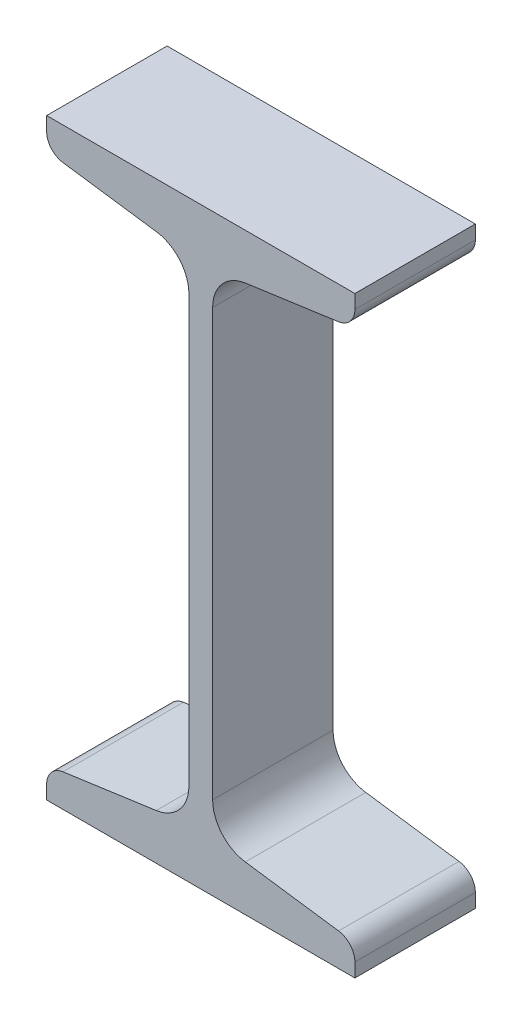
from build123d import *

# Parameters (mm, degrees)
BASESECTION_DEPTH = 12.7


with BuildPart() as part:
    # Sketch1 → BaseSection (new, symmetric)
    with BuildSketch(Plane.XY):
        with BuildLine():
            Line((-32.5, 62.5), (32.5, 62.5))
            Line((32.5, 62.5), (32.5, 59.585259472))
            ThreePointArc((32.5, 59.585259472), (31.518838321, 56.961023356), (29.056692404, 55.624187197))
            Line((29.056692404, 55.624187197), (9.386615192, 52.859738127))
            ThreePointArc((9.386615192, 52.859738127), (4.462323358, 50.186065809), (2.5, 44.937593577))
            Line((2.5, 44.937593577), (2.5, -44.937593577))
            ThreePointArc((2.5, -44.937593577), (4.462323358, -50.186065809), (9.386615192, -52.859738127))
            Line((9.386615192, -52.859738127), (29.056692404, -55.624187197))
            ThreePointArc((29.056692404, -55.624187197), (31.518838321, -56.961023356), (32.5, -59.585259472))
            Line((32.5, -59.585259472), (32.5, -62.5))
            Line((32.5, -62.5), (-32.5, -62.5))
            Line((-32.5, -62.5), (-32.5, -59.585259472))
            ThreePointArc((-32.5, -59.585259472), (-31.518838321, -56.961023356), (-29.056692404, -55.624187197))
            Line((-29.056692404, -55.624187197), (-9.386615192, -52.859738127))
            ThreePointArc((-9.386615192, -52.859738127), (-4.462323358, -50.186065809), (-2.5, -44.937593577))
            Line((-2.5, -44.937593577), (-2.5, 44.937593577))
            ThreePointArc((-2.5, 44.937593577), (-4.462323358, 50.186065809), (-9.386615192, 52.859738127))
            Line((-9.386615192, 52.859738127), (-29.056692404, 55.624187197))
            ThreePointArc((-29.056692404, 55.624187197), (-31.518838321, 56.961023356), (-32.5, 59.585259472))
            Line((-32.5, 59.585259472), (-32.5, 62.5))
        make_face()
    extrude(amount=BASESECTION_DEPTH, both=True)


solid = part.part
